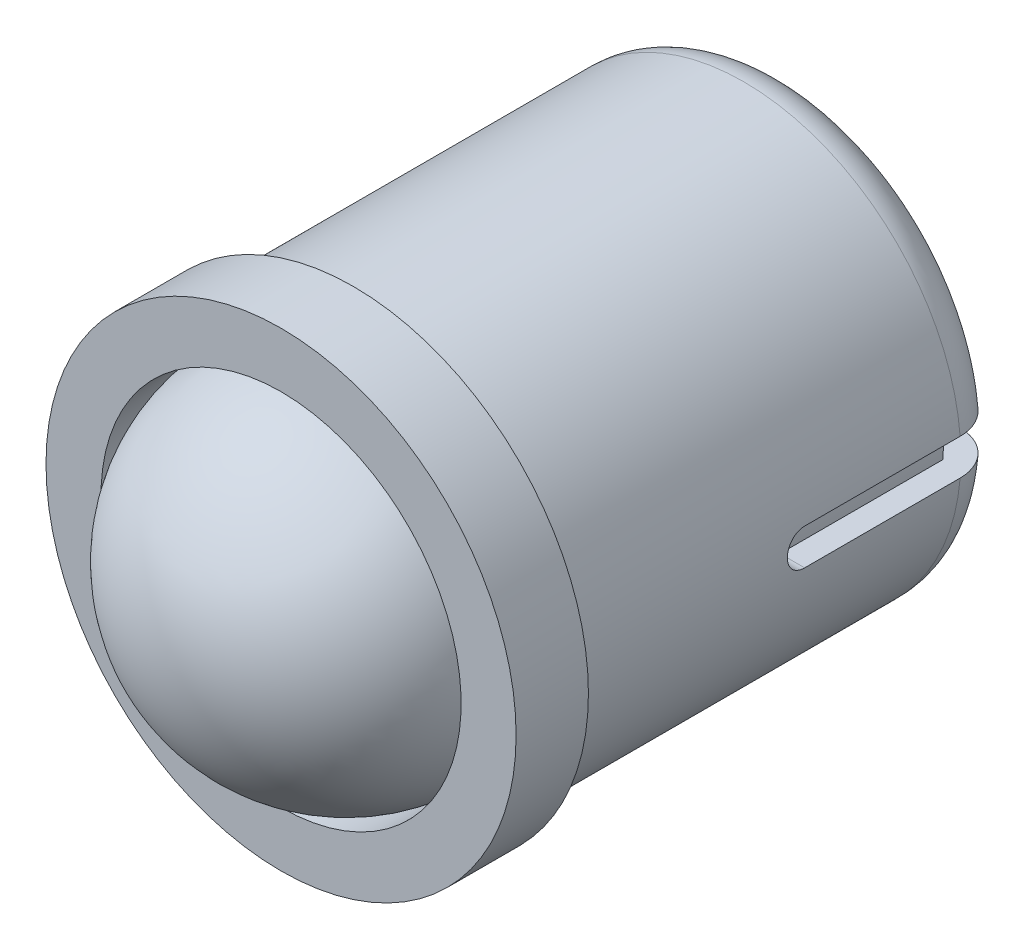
ISO-10303-21;
HEADER;
FILE_DESCRIPTION(('STEP AP214'),'2;1');
FILE_NAME('part.step','',(''),(''),'','','');
FILE_SCHEMA(('AUTOMOTIVE_DESIGN { 1 0 10303 214 1 1 1 1 }'));
ENDSEC;
DATA;
#1=APPLICATION_CONTEXT('core data for automotive mechanical design processes');
#2=APPLICATION_PROTOCOL_DEFINITION('international standard','automotive_design',2000,#1);
#3=PRODUCT_CONTEXT('',#1,'mechanical');
#4=PRODUCT('Part','Part','',(#3));
#5=PRODUCT_RELATED_PRODUCT_CATEGORY('part','',(#4));
#6=PRODUCT_DEFINITION_FORMATION('','',#4);
#7=PRODUCT_DEFINITION_CONTEXT('part definition',#1,'design');
#8=PRODUCT_DEFINITION('design','',#6,#7);
#9=PRODUCT_DEFINITION_SHAPE('','',#8);
#10=(LENGTH_UNIT() NAMED_UNIT(*) SI_UNIT(.MILLI.,.METRE.));
#11=(NAMED_UNIT(*) PLANE_ANGLE_UNIT() SI_UNIT($,.RADIAN.));
#12=(NAMED_UNIT(*) SI_UNIT($,.STERADIAN.) SOLID_ANGLE_UNIT());
#13=UNCERTAINTY_MEASURE_WITH_UNIT(LENGTH_MEASURE(1.E-05),#10,'distance_accuracy_value','');
#14=(GEOMETRIC_REPRESENTATION_CONTEXT(3) GLOBAL_UNCERTAINTY_ASSIGNED_CONTEXT((#13)) GLOBAL_UNIT_ASSIGNED_CONTEXT((#10,
#11,#12)) REPRESENTATION_CONTEXT('',''));
#15=CARTESIAN_POINT('',(0.,0.,0.));
#16=DIRECTION('',(0.,0.,1.));
#17=DIRECTION('',(1.,0.,0.));
#18=AXIS2_PLACEMENT_3D('',#15,#16,#17);
#19=CARTESIAN_POINT('',(3.25,0.,-3.25));
#20=DIRECTION('',(1.,0.,0.));
#21=DIRECTION('',(0.,1.,0.));
#22=AXIS2_PLACEMENT_3D('',#19,#20,#21);
#23=CYLINDRICAL_SURFACE('',#22,0.25);
#24=CARTESIAN_POINT('',(-2.6491943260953,0.25,-3.25));
#25=CARTESIAN_POINT('',(-2.64919448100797,0.249999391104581,-3.26400932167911));
#26=CARTESIAN_POINT('',(-2.64930664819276,0.24881846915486,-3.27802801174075));
#27=CARTESIAN_POINT('',(-2.64974315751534,0.244125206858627,-3.30567702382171));
#28=CARTESIAN_POINT('',(-2.65006773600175,0.240610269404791,-3.31930689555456));
#29=CARTESIAN_POINT('',(-2.65089198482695,0.231351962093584,-3.34577384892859));
#30=CARTESIAN_POINT('',(-2.65139155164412,0.225609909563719,-3.35861139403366));
#31=CARTESIAN_POINT('',(-2.65250936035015,0.212062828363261,-3.38313759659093));
#32=CARTESIAN_POINT('',(-2.65312757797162,0.204258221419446,-3.39482648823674));
#33=CARTESIAN_POINT('',(-2.65441526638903,0.186780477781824,-3.41676416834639));
#34=CARTESIAN_POINT('',(-2.65508487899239,0.177102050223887,-3.42700873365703));
#35=CARTESIAN_POINT('',(-2.65639861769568,0.156162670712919,-3.44573062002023));
#36=CARTESIAN_POINT('',(-2.65704274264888,0.14490164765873,-3.45420786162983));
#37=CARTESIAN_POINT('',(-2.65823431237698,0.121091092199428,-3.46916887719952));
#38=CARTESIAN_POINT('',(-2.65878157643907,0.108539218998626,-3.47564894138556));
#39=CARTESIAN_POINT('',(-2.65971622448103,0.0825195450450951,-3.4864079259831));
#40=CARTESIAN_POINT('',(-2.66010361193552,0.0690517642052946,-3.49068689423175));
#41=CARTESIAN_POINT('',(-2.66067386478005,0.041625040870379,-3.49690991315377));
#42=CARTESIAN_POINT('',(-2.6608573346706,0.0276676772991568,-3.49886086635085));
#43=CARTESIAN_POINT('',(-2.66100113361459,-0.000377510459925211,-3.50039382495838));
#44=CARTESIAN_POINT('',(-2.6609614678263,-0.0144653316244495,-3.49997588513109));
#45=CARTESIAN_POINT('',(-2.66066396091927,-0.0423246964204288,-3.49678854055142));
#46=CARTESIAN_POINT('',(-2.66040680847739,-0.0560970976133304,-3.49402655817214));
#47=CARTESIAN_POINT('',(-2.65970402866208,-0.0829819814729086,-3.48624108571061));
#48=CARTESIAN_POINT('',(-2.65925839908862,-0.0960944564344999,-3.48121756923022));
#49=CARTESIAN_POINT('',(-2.65822759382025,-0.121310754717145,-3.4690434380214));
#50=CARTESIAN_POINT('',(-2.65764220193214,-0.133412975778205,-3.46188952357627));
#51=CARTESIAN_POINT('',(-2.65639759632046,-0.1562477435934,-3.44566006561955));
#52=CARTESIAN_POINT('',(-2.65573838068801,-0.166980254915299,-3.43658447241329));
#53=CARTESIAN_POINT('',(-2.65441714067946,-0.186814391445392,-3.41672750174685));
#54=CARTESIAN_POINT('',(-2.65375511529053,-0.195909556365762,-3.40593967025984));
#55=CARTESIAN_POINT('',(-2.6525054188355,-0.212160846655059,-3.38298687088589));
#56=CARTESIAN_POINT('',(-2.65191774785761,-0.219316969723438,-3.37082190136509));
#57=CARTESIAN_POINT('',(-2.65088322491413,-0.231486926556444,-3.3454553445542));
#58=CARTESIAN_POINT('',(-2.650436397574,-0.236500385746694,-3.33225357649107));
#59=CARTESIAN_POINT('',(-2.64973465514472,-0.244237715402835,-3.30519051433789));
#60=CARTESIAN_POINT('',(-2.64947973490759,-0.246961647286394,-3.29132923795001));
#61=CARTESIAN_POINT('',(-2.64919154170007,-0.250034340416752,-3.26339727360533));
#62=CARTESIAN_POINT('',(-2.64915742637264,-0.250392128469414,-3.24932758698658));
#63=CARTESIAN_POINT('',(-2.64931248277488,-0.248746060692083,-3.22132845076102));
#64=CARTESIAN_POINT('',(-2.64950165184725,-0.246742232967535,-3.20739899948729));
#65=CARTESIAN_POINT('',(-2.65008119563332,-0.240437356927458,-3.18010189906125));
#66=CARTESIAN_POINT('',(-2.65047119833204,-0.236140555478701,-3.16673326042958));
#67=CARTESIAN_POINT('',(-2.65140816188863,-0.225376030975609,-3.14090655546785));
#68=CARTESIAN_POINT('',(-2.65195512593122,-0.218908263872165,-3.12844850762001));
#69=CARTESIAN_POINT('',(-2.65314642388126,-0.203962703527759,-3.10475541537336));
#70=CARTESIAN_POINT('',(-2.65379104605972,-0.19547891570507,-3.09352416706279));
#71=CARTESIAN_POINT('',(-2.65510407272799,-0.176750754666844,-3.07264193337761));
#72=CARTESIAN_POINT('',(-2.65577247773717,-0.166506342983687,-3.06299098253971));
#73=CARTESIAN_POINT('',(-2.65706028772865,-0.144508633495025,-3.04551229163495));
#74=CARTESIAN_POINT('',(-2.65767953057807,-0.13275065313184,-3.03769043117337));
#75=CARTESIAN_POINT('',(-2.65879689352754,-0.108082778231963,-3.02413236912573));
#76=CARTESIAN_POINT('',(-2.6592950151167,-0.0951728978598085,-3.01839614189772));
#77=CARTESIAN_POINT('',(-2.660113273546,-0.0685884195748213,-3.00918219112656));
#78=CARTESIAN_POINT('',(-2.66043369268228,-0.0549150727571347,-3.00570088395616));
#79=CARTESIAN_POINT('',(-2.66086159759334,-0.0271747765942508,-3.00108389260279));
#80=CARTESIAN_POINT('',(-2.66096908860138,-0.0131078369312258,-2.9999481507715));
#81=CARTESIAN_POINT('',(-2.66095902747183,0.0149625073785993,-3.0000552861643));
#82=CARTESIAN_POINT('',(-2.66084234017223,0.0289659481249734,-3.00128902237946));
#83=CARTESIAN_POINT('',(-2.66039874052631,0.0565657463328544,-3.00608096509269));
#84=CARTESIAN_POINT('',(-2.66007182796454,0.0701621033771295,-3.0096391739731));
#85=CARTESIAN_POINT('',(-2.65924442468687,0.0965619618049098,-3.0189766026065));
#86=CARTESIAN_POINT('',(-2.65874395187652,0.109365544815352,-3.02475559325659));
#87=CARTESIAN_POINT('',(-2.65762529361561,0.133822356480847,-3.0383695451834));
#88=CARTESIAN_POINT('',(-2.65700710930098,0.145475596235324,-3.04620448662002));
#89=CARTESIAN_POINT('',(-2.65571948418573,0.167347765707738,-3.06374225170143));
#90=CARTESIAN_POINT('',(-2.65504986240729,0.177561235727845,-3.07345187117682));
#91=CARTESIAN_POINT('',(-2.65373637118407,0.196218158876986,-3.09445030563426));
#92=CARTESIAN_POINT('',(-2.65309250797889,0.204661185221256,-3.10573950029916));
#93=CARTESIAN_POINT('',(-2.6519018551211,0.219552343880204,-3.12960433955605));
#94=CARTESIAN_POINT('',(-2.65135529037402,0.225995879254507,-3.14218286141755));
#95=CARTESIAN_POINT('',(-2.65042381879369,0.236670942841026,-3.1682402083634));
#96=CARTESIAN_POINT('',(-2.65003872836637,0.240904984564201,-3.18171799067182));
#97=CARTESIAN_POINT('',(-2.6495716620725,0.245976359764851,-3.20439444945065));
#98=CARTESIAN_POINT('',(-2.64943082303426,0.247483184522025,-3.21344780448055));
#99=CARTESIAN_POINT('',(-2.64924210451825,0.249495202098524,-3.23166610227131));
#100=CARTESIAN_POINT('',(-2.64919422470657,0.25000039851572,-3.24083104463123));
#101=CARTESIAN_POINT('',(-2.6491943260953,0.25,-3.25));
#102=B_SPLINE_CURVE_WITH_KNOTS('',3,(#24,#25,#26,#27,#28,#29,#30,#31,#32,#33,#34,#35,#36,#37,
#38,#39,#40,#41,#42,#43,#44,#45,#46,#47,#48,#49,#50,#51,#52,#53,#54,#55,#56,#57,#58,#59,#60,#61,
#62,#63,#64,#65,#66,#67,#68,#69,#70,#71,#72,#73,#74,#75,#76,#77,#78,#79,#80,#81,#82,#83,#84,#85,
#86,#87,#88,#89,#90,#91,#92,#93,#94,#95,#96,#97,#98,#99,#100,#101),.UNSPECIFIED.,.T.,.F.,(4,2,2,
2,2,2,2,2,2,2,2,2,2,2,2,2,2,2,2,2,2,2,2,2,2,2,2,2,2,2,2,2,2,2,2,2,2,2,4),(0.,0.0419944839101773,
0.084035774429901,0.126052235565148,0.168060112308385,0.210188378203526,0.252318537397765,
0.294526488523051,0.336733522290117,0.378815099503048,0.420895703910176,0.462843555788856,
0.504791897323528,0.546805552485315,0.588820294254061,0.630997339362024,0.673174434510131,
0.715358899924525,0.757542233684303,0.79956454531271,0.841586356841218,0.883530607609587,
0.925475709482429,0.967547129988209,1.00961946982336,1.05182524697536,1.09403050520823,
1.13616852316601,1.17830550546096,1.22028025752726,1.26225505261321,1.30422551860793,
1.34619557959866,1.38832074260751,1.43045604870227,1.47268752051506,1.51487084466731,
1.54235589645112,1.56984084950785),.UNSPECIFIED.);
#103=CARTESIAN_POINT('',(-2.64919432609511,-0.250000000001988,-3.25000000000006));
#104=VERTEX_POINT('',#103);
#105=CARTESIAN_POINT('',(-2.6491943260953,0.25,-3.25));
#106=VERTEX_POINT('',#105);
#107=EDGE_CURVE('E29',#104,#106,#102,.T.);
#108=ORIENTED_EDGE('',*,*,#107,.F.);
#109=DIRECTION('',(1.,0.,0.));
#110=VECTOR('',#109,1.);
#111=CARTESIAN_POINT('',(3.25,-0.25,-3.25));
#112=LINE('',#111,#110);
#113=CARTESIAN_POINT('',(-2.98956518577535,-0.25,-3.25));
#114=VERTEX_POINT('',#113);
#115=EDGE_CURVE('E79',#114,#104,#112,.T.);
#116=ORIENTED_EDGE('',*,*,#115,.F.);
#117=CARTESIAN_POINT('',(-2.98956518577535,0.25,-3.25));
#118=CARTESIAN_POINT('',(-2.98956136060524,0.250012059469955,-3.23596153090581));
#119=CARTESIAN_POINT('',(-2.98966396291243,0.248818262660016,-3.22192718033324));
#120=CARTESIAN_POINT('',(-2.9900536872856,0.244108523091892,-3.19426836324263));
#121=CARTESIAN_POINT('',(-2.99034064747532,0.240594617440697,-3.18064354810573));
#122=CARTESIAN_POINT('',(-2.99107099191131,0.231332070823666,-3.15417412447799));
#123=CARTESIAN_POINT('',(-2.99151443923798,0.225582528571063,-3.14132983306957));
#124=CARTESIAN_POINT('',(-2.99250644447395,0.212017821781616,-3.1167901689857));
#125=CARTESIAN_POINT('',(-2.99305498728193,0.204202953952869,-3.10509463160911));
#126=CARTESIAN_POINT('',(-2.99419721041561,0.186707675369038,-3.0831540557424));
#127=CARTESIAN_POINT('',(-2.99479098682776,0.177023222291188,-3.07291224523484));
#128=CARTESIAN_POINT('',(-2.99595588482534,0.156071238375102,-3.05419624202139));
#129=CARTESIAN_POINT('',(-2.99652700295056,0.144803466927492,-3.0457223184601));
#130=CARTESIAN_POINT('',(-2.99758311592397,0.120985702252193,-3.03077311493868));
#131=CARTESIAN_POINT('',(-2.9980679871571,0.108433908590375,-3.02430069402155));
#132=CARTESIAN_POINT('',(-2.99889588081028,0.0824177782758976,-3.01355686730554));
#133=CARTESIAN_POINT('',(-2.99923891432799,0.0689535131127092,-3.00928528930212));
#134=CARTESIAN_POINT('',(-2.9997438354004,0.0415271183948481,-3.00307341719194));
#135=CARTESIAN_POINT('',(-2.99990614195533,0.0275662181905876,-3.00112772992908));
#136=CARTESIAN_POINT('',(-3.00003274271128,-0.000485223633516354,-2.99960618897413));
#137=CARTESIAN_POINT('',(-2.99999703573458,-0.0145757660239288,-3.00003034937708));
#138=CARTESIAN_POINT('',(-2.99973197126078,-0.0424491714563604,-3.0032321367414));
#139=CARTESIAN_POINT('',(-2.99950309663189,-0.0562327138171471,-3.00600389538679));
#140=CARTESIAN_POINT('',(-2.99887799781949,-0.0831381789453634,-3.01381306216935));
#141=CARTESIAN_POINT('',(-2.99848177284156,-0.0962600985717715,-3.0188504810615));
#142=CARTESIAN_POINT('',(-2.99756570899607,-0.121488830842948,-3.03105463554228));
#143=CARTESIAN_POINT('',(-2.99704571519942,-0.13359434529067,-3.03822404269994));
#144=CARTESIAN_POINT('',(-2.99594058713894,-0.156431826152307,-3.05448635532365));
#145=CARTESIAN_POINT('',(-2.99535545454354,-0.167163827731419,-3.063579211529));
#146=CARTESIAN_POINT('',(-2.99418374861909,-0.186983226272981,-3.08346205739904));
#147=CARTESIAN_POINT('',(-2.99359717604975,-0.196065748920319,-3.0942569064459));
#148=CARTESIAN_POINT('',(-2.99249027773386,-0.212293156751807,-3.11722445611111));
#149=CARTESIAN_POINT('',(-2.99196997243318,-0.2194374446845,-3.12939757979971));
#150=CARTESIAN_POINT('',(-2.99105417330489,-0.23158591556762,-3.15478321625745));
#151=CARTESIAN_POINT('',(-2.99065876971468,-0.236588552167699,-3.16799647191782));
#152=CARTESIAN_POINT('',(-2.99003957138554,-0.244293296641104,-3.19506321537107));
#153=CARTESIAN_POINT('',(-2.98981551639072,-0.246998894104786,-3.20891569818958));
#154=CARTESIAN_POINT('',(-2.9896060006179,-0.249509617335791,-3.23189470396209));
#155=CARTESIAN_POINT('',(-2.98956402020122,-0.250004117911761,-3.24094962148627));
#156=CARTESIAN_POINT('',(-2.98956518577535,-0.25,-3.25));
#157=B_SPLINE_CURVE_WITH_KNOTS('',3,(#117,#118,#119,#120,#121,#122,#123,#124,#125,#126,#127,
#128,#129,#130,#131,#132,#133,#134,#135,#136,#137,#138,#139,#140,#141,#142,#143,#144,#145,#146,
#147,#148,#149,#150,#151,#152,#153,#154,#155,#156),.UNSPECIFIED.,.F.,.F.,(4,2,2,2,2,2,2,2,2,2,2,
2,2,2,2,2,2,2,2,4),(0.,0.042058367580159,0.0840798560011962,0.126118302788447,0.168150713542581,
0.210275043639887,0.252405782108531,0.294596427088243,0.336783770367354,0.378873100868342,
0.420962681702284,0.462947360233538,0.504932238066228,0.546969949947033,0.589006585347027,
0.63116548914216,0.673337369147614,0.715539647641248,0.757677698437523,0.784827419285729),.UNSPECIFIED.);
#158=CARTESIAN_POINT('',(-2.98956518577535,0.25,-3.25));
#159=VERTEX_POINT('',#158);
#160=EDGE_CURVE('E82',#159,#114,#157,.T.);
#161=ORIENTED_EDGE('',*,*,#160,.F.);
#162=DIRECTION('',(1.,0.,0.));
#163=VECTOR('',#162,1.);
#164=CARTESIAN_POINT('',(3.25,0.25,-3.25));
#165=LINE('',#164,#163);
#166=EDGE_CURVE('E74',#106,#159,#165,.F.);
#167=ORIENTED_EDGE('',*,*,#166,.F.);
#168=EDGE_LOOP('',(#108,#116,#161,#167));
#169=FACE_BOUND('',#168,.T.);
#170=ADVANCED_FACE('F14',(#169),#23,.F.);
#171=CARTESIAN_POINT('',(3.25,-0.25,-3.25));
#172=DIRECTION('',(0.,1.,0.));
#173=DIRECTION('',(0.,0.,1.));
#174=AXIS2_PLACEMENT_3D('',#171,#172,#173);
#175=PLANE('',#174);
#176=DIRECTION('',(0.,0.,1.));
#177=VECTOR('',#176,1.);
#178=CARTESIAN_POINT('',(-2.6491943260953,-0.25,4.29719094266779));
#179=LINE('',#178,#177);
#180=CARTESIAN_POINT('',(-2.6491943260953,-0.25,-5.5));
#181=VERTEX_POINT('',#180);
#182=EDGE_CURVE('E257',#104,#181,#179,.F.);
#183=ORIENTED_EDGE('',*,*,#182,.T.);
#184=DIRECTION('',(1.,0.,0.));
#185=VECTOR('',#184,1.);
#186=CARTESIAN_POINT('',(3.25,-0.25,-5.5));
#187=LINE('',#186,#185);
#188=CARTESIAN_POINT('',(2.6491943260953,-0.25,-5.5));
#189=VERTEX_POINT('',#188);
#190=EDGE_CURVE('E86',#181,#189,#187,.T.);
#191=ORIENTED_EDGE('',*,*,#190,.T.);
#192=DIRECTION('',(0.,0.,1.));
#193=VECTOR('',#192,1.);
#194=CARTESIAN_POINT('',(2.6491943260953,-0.25,4.29719094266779));
#195=LINE('',#194,#193);
#196=CARTESIAN_POINT('',(2.64919432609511,-0.250000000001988,-3.24999999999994));
#197=VERTEX_POINT('',#196);
#198=EDGE_CURVE('E256',#189,#197,#195,.T.);
#199=ORIENTED_EDGE('',*,*,#198,.T.);
#200=DIRECTION('',(1.,0.,0.));
#201=VECTOR('',#200,1.);
#202=CARTESIAN_POINT('',(3.25,-0.25,-3.25));
#203=LINE('',#202,#201);
#204=CARTESIAN_POINT('',(2.98956518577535,-0.25,-3.25));
#205=VERTEX_POINT('',#204);
#206=EDGE_CURVE('E67',#197,#205,#203,.T.);
#207=ORIENTED_EDGE('',*,*,#206,.T.);
#208=DIRECTION('',(0.,0.,-1.));
#209=VECTOR('',#208,1.);
#210=CARTESIAN_POINT('',(2.98956518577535,-0.25,1.));
#211=LINE('',#210,#209);
#212=CARTESIAN_POINT('',(2.98956518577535,-0.25,-5.4));
#213=VERTEX_POINT('',#212);
#214=EDGE_CURVE('E175',#213,#205,#211,.F.);
#215=ORIENTED_EDGE('',*,*,#214,.F.);
#216=CARTESIAN_POINT('',(2.98956518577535,-0.25,-5.4));
#217=CARTESIAN_POINT('',(2.98959425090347,-0.25,-5.43366459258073));
#218=CARTESIAN_POINT('',(2.9867237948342,-0.25,-5.46732005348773));
#219=CARTESIAN_POINT('',(2.97539897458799,-0.25,-5.53364919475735));
#220=CARTESIAN_POINT('',(2.966949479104,-0.25,-5.5663237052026));
#221=CARTESIAN_POINT('',(2.94467598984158,-0.25,-5.62980372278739));
#222=CARTESIAN_POINT('',(2.930849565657,-0.25,-5.66060837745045));
#223=CARTESIAN_POINT('',(2.89823201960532,-0.25,-5.71945898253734));
#224=CARTESIAN_POINT('',(2.87944165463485,-0.25,-5.74750535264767));
#225=CARTESIAN_POINT('',(2.83740161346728,-0.25,-5.80009386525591));
#226=CARTESIAN_POINT('',(2.81414566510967,-0.25,-5.82463099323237));
#227=CARTESIAN_POINT('',(2.76385593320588,-0.25,-5.86946850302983));
#228=CARTESIAN_POINT('',(2.73682208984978,-0.25,-5.88976881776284));
#229=CARTESIAN_POINT('',(2.6796443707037,-0.25,-5.92563543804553));
#230=CARTESIAN_POINT('',(2.64948958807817,-0.25,-5.94118433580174));
#231=CARTESIAN_POINT('',(2.5870102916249,-0.25,-5.9670162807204));
#232=CARTESIAN_POINT('',(2.55468688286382,-0.25,-5.97730198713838));
#233=CARTESIAN_POINT('',(2.49964171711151,-0.25,-5.98986571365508));
#234=CARTESIAN_POINT('',(2.4772548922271,-0.250000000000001,-5.99366441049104));
#235=CARTESIAN_POINT('',(2.43222950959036,-0.249999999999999,-5.99873127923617));
#236=CARTESIAN_POINT('',(2.40959136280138,-0.249999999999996,-6.00000310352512));
#237=CARTESIAN_POINT('',(2.38694365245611,-0.24999999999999,-6.));
#238=B_SPLINE_CURVE_WITH_KNOTS('',3,(#216,#217,#218,#219,#220,#221,#222,#223,#224,#225,#226,
#227,#228,#229,#230,#231,#232,#233,#234,#235,#236,#237),.UNSPECIFIED.,.F.,.F.,(4,2,2,2,2,2,2,2,
2,2,4),(0.,0.10085842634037,0.201628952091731,0.302445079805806,0.403245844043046,
0.504189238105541,0.60513423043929,0.706444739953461,0.807704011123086,0.875691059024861,
0.943579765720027),.UNSPECIFIED.);
#239=CARTESIAN_POINT('',(2.38694365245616,-0.250000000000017,-6.));
#240=VERTEX_POINT('',#239);
#241=EDGE_CURVE('E60',#213,#240,#238,.T.);
#242=ORIENTED_EDGE('',*,*,#241,.T.);
#243=DIRECTION('',(1.,0.,0.));
#244=VECTOR('',#243,1.);
#245=CARTESIAN_POINT('',(3.25,-0.25,-6.));
#246=LINE('',#245,#244);
#247=CARTESIAN_POINT('',(-2.3869436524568,-0.25,-6.));
#248=VERTEX_POINT('',#247);
#249=EDGE_CURVE('E166',#240,#248,#246,.F.);
#250=ORIENTED_EDGE('',*,*,#249,.T.);
#251=CARTESIAN_POINT('',(-2.3869436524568,-0.25,-6.));
#252=CARTESIAN_POINT('',(-2.42096660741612,-0.25,-6.0000285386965));
#253=CARTESIAN_POINT('',(-2.45498308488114,-0.25,-5.99713914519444));
#254=CARTESIAN_POINT('',(-2.52203674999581,-0.25,-5.98572468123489));
#255=CARTESIAN_POINT('',(-2.5550745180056,-0.25,-5.97720302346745));
#256=CARTESIAN_POINT('',(-2.61926643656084,-0.25,-5.95471728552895));
#257=CARTESIAN_POINT('',(-2.65041948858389,-0.25,-5.94075006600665));
#258=CARTESIAN_POINT('',(-2.70992158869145,-0.25,-5.90777241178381));
#259=CARTESIAN_POINT('',(-2.73827129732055,-0.25,-5.88876316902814));
#260=CARTESIAN_POINT('',(-2.79127590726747,-0.25,-5.84629567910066));
#261=CARTESIAN_POINT('',(-2.81594163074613,-0.25,-5.82285094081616));
#262=CARTESIAN_POINT('',(-2.86096609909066,-0.25,-5.7721378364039));
#263=CARTESIAN_POINT('',(-2.88132505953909,-0.25,-5.74486966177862));
#264=CARTESIAN_POINT('',(-2.91707626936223,-0.25,-5.68740014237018));
#265=CARTESIAN_POINT('',(-2.93248722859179,-0.25,-5.65721042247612));
#266=CARTESIAN_POINT('',(-2.95799606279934,-0.25,-5.59467339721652));
#267=CARTESIAN_POINT('',(-2.96809733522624,-0.25,-5.56232748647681));
#268=CARTESIAN_POINT('',(-2.98010771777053,-0.25,-5.50814258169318));
#269=CARTESIAN_POINT('',(-2.98365219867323,-0.250000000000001,-5.48665205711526));
#270=CARTESIAN_POINT('',(-2.98838052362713,-0.249999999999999,-5.44344410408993));
#271=CARTESIAN_POINT('',(-2.98956774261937,-0.249999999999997,-5.42172704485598));
#272=CARTESIAN_POINT('',(-2.98956518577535,-0.249999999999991,-5.4));
#273=B_SPLINE_CURVE_WITH_KNOTS('',3,(#251,#252,#253,#254,#255,#256,#257,#258,#259,#260,#261,
#262,#263,#264,#265,#266,#267,#268,#269,#270,#271,#272),.UNSPECIFIED.,.F.,.F.,(4,2,2,2,2,2,2,2,
2,2,4),(0.,0.101937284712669,0.203812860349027,0.305747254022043,0.407657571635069,
0.509262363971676,0.610862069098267,0.712072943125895,0.813218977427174,0.878441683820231,
0.943570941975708),.UNSPECIFIED.);
#274=CARTESIAN_POINT('',(-2.98956518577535,-0.25,-5.4));
#275=VERTEX_POINT('',#274);
#276=EDGE_CURVE('E94',#248,#275,#273,.T.);
#277=ORIENTED_EDGE('',*,*,#276,.T.);
#278=DIRECTION('',(0.,0.,-1.));
#279=VECTOR('',#278,1.);
#280=CARTESIAN_POINT('',(-2.98956518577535,-0.25,1.));
#281=LINE('',#280,#279);
#282=EDGE_CURVE('E90',#114,#275,#281,.T.);
#283=ORIENTED_EDGE('',*,*,#282,.F.);
#284=ORIENTED_EDGE('',*,*,#115,.T.);
#285=EDGE_LOOP('',(#183,#191,#199,#207,#215,#242,#250,#277,#283,#284));
#286=FACE_BOUND('',#285,.T.);
#287=ADVANCED_FACE('F91',(#286),#175,.T.);
#288=CARTESIAN_POINT('',(3.25,0.,-3.25));
#289=DIRECTION('',(1.,0.,0.));
#290=DIRECTION('',(0.,1.,0.));
#291=AXIS2_PLACEMENT_3D('',#288,#289,#290);
#292=CYLINDRICAL_SURFACE('',#291,0.25);
#293=CARTESIAN_POINT('',(2.6491943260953,0.25,-3.25));
#294=CARTESIAN_POINT('',(2.64919448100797,0.249999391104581,-3.23599067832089));
#295=CARTESIAN_POINT('',(2.64930664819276,0.24881846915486,-3.22197198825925));
#296=CARTESIAN_POINT('',(2.64974315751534,0.244125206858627,-3.19432297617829));
#297=CARTESIAN_POINT('',(2.65006773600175,0.240610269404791,-3.18069310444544));
#298=CARTESIAN_POINT('',(2.65089198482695,0.231351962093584,-3.15422615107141));
#299=CARTESIAN_POINT('',(2.65139155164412,0.225609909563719,-3.14138860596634));
#300=CARTESIAN_POINT('',(2.65250936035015,0.212062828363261,-3.11686240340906));
#301=CARTESIAN_POINT('',(2.65312757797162,0.204258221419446,-3.10517351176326));
#302=CARTESIAN_POINT('',(2.65441526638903,0.186780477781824,-3.08323583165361));
#303=CARTESIAN_POINT('',(2.65508487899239,0.177102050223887,-3.07299126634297));
#304=CARTESIAN_POINT('',(2.65639861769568,0.156162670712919,-3.05426937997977));
#305=CARTESIAN_POINT('',(2.65704274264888,0.14490164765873,-3.04579213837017));
#306=CARTESIAN_POINT('',(2.65823431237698,0.121091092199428,-3.03083112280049));
#307=CARTESIAN_POINT('',(2.65878157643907,0.108539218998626,-3.02435105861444));
#308=CARTESIAN_POINT('',(2.65971622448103,0.0825195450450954,-3.0135920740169));
#309=CARTESIAN_POINT('',(2.66010361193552,0.0690517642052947,-3.00931310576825));
#310=CARTESIAN_POINT('',(2.66067386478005,0.041625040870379,-3.00309008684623));
#311=CARTESIAN_POINT('',(2.6608573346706,0.0276676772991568,-3.00113913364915));
#312=CARTESIAN_POINT('',(2.66100113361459,-0.000377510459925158,-2.99960617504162));
#313=CARTESIAN_POINT('',(2.6609614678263,-0.0144653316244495,-3.00002411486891));
#314=CARTESIAN_POINT('',(2.66066396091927,-0.0423246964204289,-3.00321145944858));
#315=CARTESIAN_POINT('',(2.66040680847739,-0.0560970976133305,-3.00597344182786));
#316=CARTESIAN_POINT('',(2.65970402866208,-0.0829819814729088,-3.01375891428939));
#317=CARTESIAN_POINT('',(2.65925839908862,-0.0960944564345,-3.01878243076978));
#318=CARTESIAN_POINT('',(2.65822759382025,-0.121310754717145,-3.0309565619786));
#319=CARTESIAN_POINT('',(2.65764220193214,-0.133412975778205,-3.03811047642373));
#320=CARTESIAN_POINT('',(2.65639759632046,-0.1562477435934,-3.05433993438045));
#321=CARTESIAN_POINT('',(2.65573838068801,-0.166980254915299,-3.06341552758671));
#322=CARTESIAN_POINT('',(2.65441714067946,-0.186814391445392,-3.08327249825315));
#323=CARTESIAN_POINT('',(2.65375511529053,-0.195909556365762,-3.09406032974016));
#324=CARTESIAN_POINT('',(2.6525054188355,-0.21216084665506,-3.11701312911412));
#325=CARTESIAN_POINT('',(2.65191774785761,-0.219316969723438,-3.12917809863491));
#326=CARTESIAN_POINT('',(2.65088322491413,-0.231486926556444,-3.1545446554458));
#327=CARTESIAN_POINT('',(2.650436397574,-0.236500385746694,-3.16774642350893));
#328=CARTESIAN_POINT('',(2.64973465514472,-0.244237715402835,-3.19480948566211));
#329=CARTESIAN_POINT('',(2.64947973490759,-0.246961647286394,-3.20867076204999));
#330=CARTESIAN_POINT('',(2.64919154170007,-0.250034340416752,-3.23660272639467));
#331=CARTESIAN_POINT('',(2.64915742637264,-0.250392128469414,-3.25067241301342));
#332=CARTESIAN_POINT('',(2.64931248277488,-0.248746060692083,-3.27867154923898));
#333=CARTESIAN_POINT('',(2.64950165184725,-0.246742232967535,-3.29260100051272));
#334=CARTESIAN_POINT('',(2.65008119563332,-0.240437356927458,-3.31989810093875));
#335=CARTESIAN_POINT('',(2.65047119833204,-0.236140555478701,-3.33326673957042));
#336=CARTESIAN_POINT('',(2.65140816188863,-0.225376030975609,-3.35909344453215));
#337=CARTESIAN_POINT('',(2.65195512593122,-0.218908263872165,-3.37155149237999));
#338=CARTESIAN_POINT('',(2.65314642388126,-0.203962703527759,-3.39524458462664));
#339=CARTESIAN_POINT('',(2.65379104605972,-0.19547891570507,-3.40647583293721));
#340=CARTESIAN_POINT('',(2.65510407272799,-0.176750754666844,-3.42735806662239));
#341=CARTESIAN_POINT('',(2.65577247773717,-0.166506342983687,-3.43700901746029));
#342=CARTESIAN_POINT('',(2.65706028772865,-0.144508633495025,-3.45448770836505));
#343=CARTESIAN_POINT('',(2.65767953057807,-0.13275065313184,-3.46230956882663));
#344=CARTESIAN_POINT('',(2.65879689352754,-0.108082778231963,-3.47586763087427));
#345=CARTESIAN_POINT('',(2.6592950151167,-0.0951728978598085,-3.48160385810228));
#346=CARTESIAN_POINT('',(2.660113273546,-0.0685884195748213,-3.49081780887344));
#347=CARTESIAN_POINT('',(2.66043369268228,-0.0549150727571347,-3.49429911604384));
#348=CARTESIAN_POINT('',(2.66086159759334,-0.0271747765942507,-3.49891610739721));
#349=CARTESIAN_POINT('',(2.66096908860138,-0.0131078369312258,-3.5000518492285));
#350=CARTESIAN_POINT('',(2.66095902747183,0.0149625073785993,-3.4999447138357));
#351=CARTESIAN_POINT('',(2.66084234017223,0.0289659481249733,-3.49871097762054));
#352=CARTESIAN_POINT('',(2.66039874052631,0.0565657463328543,-3.49391903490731));
#353=CARTESIAN_POINT('',(2.66007182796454,0.0701621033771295,-3.4903608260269));
#354=CARTESIAN_POINT('',(2.65924442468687,0.0965619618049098,-3.4810233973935));
#355=CARTESIAN_POINT('',(2.65874395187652,0.109365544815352,-3.47524440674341));
#356=CARTESIAN_POINT('',(2.65762529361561,0.133822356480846,-3.4616304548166));
#357=CARTESIAN_POINT('',(2.65700710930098,0.145475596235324,-3.45379551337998));
#358=CARTESIAN_POINT('',(2.65571948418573,0.167347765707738,-3.43625774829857));
#359=CARTESIAN_POINT('',(2.65504986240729,0.177561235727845,-3.42654812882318));
#360=CARTESIAN_POINT('',(2.65373637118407,0.196218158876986,-3.40554969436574));
#361=CARTESIAN_POINT('',(2.65309250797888,0.204661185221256,-3.39426049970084));
#362=CARTESIAN_POINT('',(2.6519018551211,0.219552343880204,-3.37039566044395));
#363=CARTESIAN_POINT('',(2.65135529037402,0.225995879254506,-3.35781713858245));
#364=CARTESIAN_POINT('',(2.65042381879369,0.236670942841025,-3.3317597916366));
#365=CARTESIAN_POINT('',(2.65003872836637,0.240904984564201,-3.31828200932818));
#366=CARTESIAN_POINT('',(2.6495716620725,0.245976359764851,-3.29560555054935));
#367=CARTESIAN_POINT('',(2.64943082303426,0.247483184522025,-3.28655219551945));
#368=CARTESIAN_POINT('',(2.64924210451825,0.249495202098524,-3.26833389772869));
#369=CARTESIAN_POINT('',(2.64919422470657,0.25000039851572,-3.25916895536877));
#370=CARTESIAN_POINT('',(2.6491943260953,0.25,-3.25));
#371=B_SPLINE_CURVE_WITH_KNOTS('',3,(#293,#294,#295,#296,#297,#298,#299,#300,#301,#302,#303,
#304,#305,#306,#307,#308,#309,#310,#311,#312,#313,#314,#315,#316,#317,#318,#319,#320,#321,#322,
#323,#324,#325,#326,#327,#328,#329,#330,#331,#332,#333,#334,#335,#336,#337,#338,#339,#340,#341,
#342,#343,#344,#345,#346,#347,#348,#349,#350,#351,#352,#353,#354,#355,#356,#357,#358,#359,#360,
#361,#362,#363,#364,#365,#366,#367,#368,#369,#370),.UNSPECIFIED.,.T.,.F.,(4,2,2,2,2,2,2,2,2,2,2,
2,2,2,2,2,2,2,2,2,2,2,2,2,2,2,2,2,2,2,2,2,2,2,2,2,2,2,4),(0.,0.0419944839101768,
0.0840357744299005,0.126052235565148,0.168060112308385,0.210188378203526,0.252318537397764,
0.294526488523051,0.336733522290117,0.378815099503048,0.420895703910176,0.462843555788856,
0.504791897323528,0.546805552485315,0.58882029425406,0.630997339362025,0.673174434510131,
0.715358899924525,0.757542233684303,0.79956454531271,0.841586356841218,0.883530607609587,
0.925475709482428,0.967547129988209,1.00961946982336,1.05182524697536,1.09403050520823,
1.13616852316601,1.17830550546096,1.22028025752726,1.26225505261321,1.30422551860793,
1.34619557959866,1.38832074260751,1.43045604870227,1.47268752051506,1.51487084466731,
1.54235589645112,1.56984084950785),.UNSPECIFIED.);
#372=CARTESIAN_POINT('',(2.6491943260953,0.25,-3.25));
#373=VERTEX_POINT('',#372);
#374=EDGE_CURVE('E248',#373,#197,#371,.T.);
#375=ORIENTED_EDGE('',*,*,#374,.F.);
#376=DIRECTION('',(1.,0.,0.));
#377=VECTOR('',#376,1.);
#378=CARTESIAN_POINT('',(3.25,0.25,-3.25));
#379=LINE('',#378,#377);
#380=CARTESIAN_POINT('',(2.98956518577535,0.25,-3.25));
#381=VERTEX_POINT('',#380);
#382=EDGE_CURVE('E160',#381,#373,#379,.F.);
#383=ORIENTED_EDGE('',*,*,#382,.F.);
#384=CARTESIAN_POINT('',(2.98956518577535,-0.25,-3.25));
#385=CARTESIAN_POINT('',(2.98956136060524,-0.250012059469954,-3.23596153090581));
#386=CARTESIAN_POINT('',(2.98966396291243,-0.248818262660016,-3.22192718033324));
#387=CARTESIAN_POINT('',(2.9900536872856,-0.244108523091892,-3.19426836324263));
#388=CARTESIAN_POINT('',(2.99034064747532,-0.240594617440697,-3.18064354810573));
#389=CARTESIAN_POINT('',(2.99107099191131,-0.231332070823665,-3.15417412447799));
#390=CARTESIAN_POINT('',(2.99151443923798,-0.225582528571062,-3.14132983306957));
#391=CARTESIAN_POINT('',(2.99250644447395,-0.212017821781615,-3.1167901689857));
#392=CARTESIAN_POINT('',(2.99305498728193,-0.204202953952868,-3.10509463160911));
#393=CARTESIAN_POINT('',(2.99419721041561,-0.186707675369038,-3.0831540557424));
#394=CARTESIAN_POINT('',(2.99479098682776,-0.177023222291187,-3.07291224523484));
#395=CARTESIAN_POINT('',(2.99595588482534,-0.156071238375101,-3.05419624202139));
#396=CARTESIAN_POINT('',(2.99652700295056,-0.144803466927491,-3.0457223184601));
#397=CARTESIAN_POINT('',(2.99758311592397,-0.120985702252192,-3.03077311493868));
#398=CARTESIAN_POINT('',(2.9980679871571,-0.108433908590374,-3.02430069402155));
#399=CARTESIAN_POINT('',(2.99889588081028,-0.0824177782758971,-3.01355686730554));
#400=CARTESIAN_POINT('',(2.99923891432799,-0.0689535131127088,-3.00928528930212));
#401=CARTESIAN_POINT('',(2.9997438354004,-0.0415271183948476,-3.00307341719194));
#402=CARTESIAN_POINT('',(2.99990614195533,-0.0275662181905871,-3.00112772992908));
#403=CARTESIAN_POINT('',(3.00003274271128,0.000485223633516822,-2.99960618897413));
#404=CARTESIAN_POINT('',(2.99999703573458,0.0145757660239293,-3.00003034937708));
#405=CARTESIAN_POINT('',(2.99973197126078,0.0424491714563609,-3.0032321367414));
#406=CARTESIAN_POINT('',(2.99950309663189,0.0562327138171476,-3.00600389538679));
#407=CARTESIAN_POINT('',(2.99887799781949,0.083138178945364,-3.01381306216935));
#408=CARTESIAN_POINT('',(2.99848177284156,0.0962600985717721,-3.0188504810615));
#409=CARTESIAN_POINT('',(2.99756570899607,0.121488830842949,-3.03105463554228));
#410=CARTESIAN_POINT('',(2.99704571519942,0.13359434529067,-3.03822404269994));
#411=CARTESIAN_POINT('',(2.99594058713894,0.156431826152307,-3.05448635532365));
#412=CARTESIAN_POINT('',(2.99535545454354,0.16716382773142,-3.063579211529));
#413=CARTESIAN_POINT('',(2.99418374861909,0.186983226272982,-3.08346205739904));
#414=CARTESIAN_POINT('',(2.99359717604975,0.19606574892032,-3.0942569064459));
#415=CARTESIAN_POINT('',(2.99249027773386,0.212293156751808,-3.11722445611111));
#416=CARTESIAN_POINT('',(2.99196997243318,0.219437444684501,-3.12939757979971));
#417=CARTESIAN_POINT('',(2.99105417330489,0.23158591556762,-3.15478321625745));
#418=CARTESIAN_POINT('',(2.99065876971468,0.2365885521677,-3.16799647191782));
#419=CARTESIAN_POINT('',(2.99003957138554,0.244293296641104,-3.19506321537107));
#420=CARTESIAN_POINT('',(2.98981551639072,0.246998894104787,-3.20891569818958));
#421=CARTESIAN_POINT('',(2.9896060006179,0.249509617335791,-3.23189470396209));
#422=CARTESIAN_POINT('',(2.98956402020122,0.250004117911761,-3.24094962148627));
#423=CARTESIAN_POINT('',(2.98956518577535,0.25,-3.25));
#424=B_SPLINE_CURVE_WITH_KNOTS('',3,(#384,#385,#386,#387,#388,#389,#390,#391,#392,#393,#394,
#395,#396,#397,#398,#399,#400,#401,#402,#403,#404,#405,#406,#407,#408,#409,#410,#411,#412,#413,
#414,#415,#416,#417,#418,#419,#420,#421,#422,#423),.UNSPECIFIED.,.F.,.F.,(4,2,2,2,2,2,2,2,2,2,2,
2,2,2,2,2,2,2,2,4),(0.,0.0420583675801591,0.0840798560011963,0.126118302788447,
0.168150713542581,0.210275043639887,0.252405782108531,0.294596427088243,0.336783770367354,
0.378873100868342,0.420962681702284,0.462947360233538,0.504932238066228,0.546969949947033,
0.589006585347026,0.63116548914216,0.673337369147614,0.715539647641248,0.757677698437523,
0.784827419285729),.UNSPECIFIED.);
#425=EDGE_CURVE('E115',#205,#381,#424,.T.);
#426=ORIENTED_EDGE('',*,*,#425,.F.);
#427=ORIENTED_EDGE('',*,*,#206,.F.);
#428=EDGE_LOOP('',(#375,#383,#426,#427));
#429=FACE_BOUND('',#428,.T.);
#430=ADVANCED_FACE('F236',(#429),#292,.F.);
#431=CARTESIAN_POINT('',(3.25,0.25,-6.));
#432=DIRECTION('',(0.,-1.,0.));
#433=DIRECTION('',(0.,0.,-1.));
#434=AXIS2_PLACEMENT_3D('',#431,#432,#433);
#435=PLANE('',#434);
#436=DIRECTION('',(0.,0.,1.));
#437=VECTOR('',#436,1.);
#438=CARTESIAN_POINT('',(2.6491943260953,0.25,4.29719094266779));
#439=LINE('',#438,#437);
#440=CARTESIAN_POINT('',(2.6491943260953,0.25,-5.5));
#441=VERTEX_POINT('',#440);
#442=EDGE_CURVE('E9',#373,#441,#439,.F.);
#443=ORIENTED_EDGE('',*,*,#442,.T.);
#444=DIRECTION('',(1.,0.,0.));
#445=VECTOR('',#444,1.);
#446=CARTESIAN_POINT('',(3.25,0.25,-5.5));
#447=LINE('',#446,#445);
#448=CARTESIAN_POINT('',(-2.6491943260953,0.25,-5.5));
#449=VERTEX_POINT('',#448);
#450=EDGE_CURVE('E157',#441,#449,#447,.F.);
#451=ORIENTED_EDGE('',*,*,#450,.T.);
#452=DIRECTION('',(0.,0.,1.));
#453=VECTOR('',#452,1.);
#454=CARTESIAN_POINT('',(-2.6491943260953,0.25,4.29719094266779));
#455=LINE('',#454,#453);
#456=EDGE_CURVE('E22',#449,#106,#455,.T.);
#457=ORIENTED_EDGE('',*,*,#456,.T.);
#458=ORIENTED_EDGE('',*,*,#166,.T.);
#459=DIRECTION('',(0.,0.,-1.));
#460=VECTOR('',#459,1.);
#461=CARTESIAN_POINT('',(-2.98956518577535,0.25,1.));
#462=LINE('',#461,#460);
#463=CARTESIAN_POINT('',(-2.98956518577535,0.25,-5.4));
#464=VERTEX_POINT('',#463);
#465=EDGE_CURVE('E103',#464,#159,#462,.F.);
#466=ORIENTED_EDGE('',*,*,#465,.F.);
#467=CARTESIAN_POINT('',(-2.38694365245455,0.25,-6.));
#468=CARTESIAN_POINT('',(-2.42096660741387,0.25,-6.00002853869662));
#469=CARTESIAN_POINT('',(-2.4549830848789,0.25,-5.99713914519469));
#470=CARTESIAN_POINT('',(-2.52203674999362,0.25,-5.98572468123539));
#471=CARTESIAN_POINT('',(-2.55507451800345,0.25,-5.97720302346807));
#472=CARTESIAN_POINT('',(-2.61926643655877,0.25,-5.95471728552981));
#473=CARTESIAN_POINT('',(-2.65041948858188,0.25,-5.94075006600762));
#474=CARTESIAN_POINT('',(-2.70992158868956,0.25,-5.907772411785));
#475=CARTESIAN_POINT('',(-2.73827129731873,0.25,-5.88876316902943));
#476=CARTESIAN_POINT('',(-2.79127590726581,0.25,-5.84629567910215));
#477=CARTESIAN_POINT('',(-2.81594163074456,0.25,-5.82285094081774));
#478=CARTESIAN_POINT('',(-2.86096609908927,0.25,-5.77213783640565));
#479=CARTESIAN_POINT('',(-2.88132505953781,0.25,-5.74486966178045));
#480=CARTESIAN_POINT('',(-2.91707626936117,0.25,-5.68740014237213));
#481=CARTESIAN_POINT('',(-2.93248722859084,0.25,-5.65721042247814));
#482=CARTESIAN_POINT('',(-2.95799606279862,0.25,-5.59467339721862));
#483=CARTESIAN_POINT('',(-2.96809733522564,0.25,-5.56232748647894));
#484=CARTESIAN_POINT('',(-2.98010771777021,0.25,-5.508142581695));
#485=CARTESIAN_POINT('',(-2.98365219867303,0.25,-5.48665205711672));
#486=CARTESIAN_POINT('',(-2.98838052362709,0.25,-5.44344410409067));
#487=CARTESIAN_POINT('',(-2.98956774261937,0.249999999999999,-5.42172704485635));
#488=CARTESIAN_POINT('',(-2.98956518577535,0.249999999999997,-5.4));
#489=B_SPLINE_CURVE_WITH_KNOTS('',3,(#467,#468,#469,#470,#471,#472,#473,#474,#475,#476,#477,
#478,#479,#480,#481,#482,#483,#484,#485,#486,#487,#488),.UNSPECIFIED.,.F.,.F.,(4,2,2,2,2,2,2,2,
2,2,4),(0.,0.101937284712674,0.203812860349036,0.305747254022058,0.407657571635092,
0.509262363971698,0.61086206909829,0.712072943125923,0.81321897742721,0.878441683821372,
0.943570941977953),.UNSPECIFIED.);
#490=CARTESIAN_POINT('',(-2.38694365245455,0.250000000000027,-6.));
#491=VERTEX_POINT('',#490);
#492=EDGE_CURVE('E454',#491,#464,#489,.T.);
#493=ORIENTED_EDGE('',*,*,#492,.F.);
#494=DIRECTION('',(1.,0.,0.));
#495=VECTOR('',#494,1.);
#496=CARTESIAN_POINT('',(3.25,0.25,-6.));
#497=LINE('',#496,#495);
#498=CARTESIAN_POINT('',(2.38694365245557,0.25,-6.));
#499=VERTEX_POINT('',#498);
#500=EDGE_CURVE('E152',#491,#499,#497,.T.);
#501=ORIENTED_EDGE('',*,*,#500,.T.);
#502=CARTESIAN_POINT('',(2.98956518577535,0.25,-5.4));
#503=CARTESIAN_POINT('',(2.98959425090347,0.25,-5.43366459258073));
#504=CARTESIAN_POINT('',(2.9867237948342,0.25,-5.46732005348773));
#505=CARTESIAN_POINT('',(2.97539897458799,0.25,-5.53364919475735));
#506=CARTESIAN_POINT('',(2.966949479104,0.25,-5.5663237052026));
#507=CARTESIAN_POINT('',(2.94467598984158,0.25,-5.62980372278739));
#508=CARTESIAN_POINT('',(2.930849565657,0.25,-5.66060837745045));
#509=CARTESIAN_POINT('',(2.89823201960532,0.25,-5.71945898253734));
#510=CARTESIAN_POINT('',(2.87944165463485,0.25,-5.74750535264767));
#511=CARTESIAN_POINT('',(2.83740161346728,0.25,-5.80009386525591));
#512=CARTESIAN_POINT('',(2.81414566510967,0.25,-5.82463099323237));
#513=CARTESIAN_POINT('',(2.76385593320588,0.25,-5.86946850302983));
#514=CARTESIAN_POINT('',(2.73682208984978,0.25,-5.88976881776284));
#515=CARTESIAN_POINT('',(2.6796443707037,0.25,-5.92563543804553));
#516=CARTESIAN_POINT('',(2.64948958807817,0.25,-5.94118433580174));
#517=CARTESIAN_POINT('',(2.5870102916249,0.25,-5.9670162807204));
#518=CARTESIAN_POINT('',(2.55468688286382,0.25,-5.97730198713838));
#519=CARTESIAN_POINT('',(2.49964171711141,0.25,-5.9898657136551));
#520=CARTESIAN_POINT('',(2.4772548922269,0.250000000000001,-5.99366441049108));
#521=CARTESIAN_POINT('',(2.43222950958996,0.249999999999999,-5.99873127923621));
#522=CARTESIAN_POINT('',(2.40959136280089,0.249999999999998,-6.00000310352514));
#523=CARTESIAN_POINT('',(2.38694365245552,0.249999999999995,-6.));
#524=B_SPLINE_CURVE_WITH_KNOTS('',3,(#502,#503,#504,#505,#506,#507,#508,#509,#510,#511,#512,
#513,#514,#515,#516,#517,#518,#519,#520,#521,#522,#523),.UNSPECIFIED.,.F.,.F.,(4,2,2,2,2,2,2,2,
2,2,4),(0.,0.10085842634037,0.201628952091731,0.302445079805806,0.403245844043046,
0.504189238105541,0.60513423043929,0.706444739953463,0.807704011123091,0.875691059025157,
0.943579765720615),.UNSPECIFIED.);
#525=CARTESIAN_POINT('',(2.98956518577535,0.25,-5.4));
#526=VERTEX_POINT('',#525);
#527=EDGE_CURVE('E38',#526,#499,#524,.T.);
#528=ORIENTED_EDGE('',*,*,#527,.F.);
#529=DIRECTION('',(0.,0.,-1.));
#530=VECTOR('',#529,1.);
#531=CARTESIAN_POINT('',(2.98956518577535,0.25,1.));
#532=LINE('',#531,#530);
#533=EDGE_CURVE('E151',#381,#526,#532,.T.);
#534=ORIENTED_EDGE('',*,*,#533,.F.);
#535=ORIENTED_EDGE('',*,*,#382,.T.);
#536=EDGE_LOOP('',(#443,#451,#457,#458,#466,#493,#501,#528,#534,#535));
#537=FACE_BOUND('',#536,.T.);
#538=ADVANCED_FACE('F141',(#537),#435,.T.);
#539=CARTESIAN_POINT('',(0.,0.,1.));
#540=DIRECTION('',(0.,0.,-1.));
#541=DIRECTION('',(0.,1.,0.));
#542=AXIS2_PLACEMENT_3D('',#539,#540,#541);
#543=CYLINDRICAL_SURFACE('',#542,2.49);
#544=CARTESIAN_POINT('',(0.,0.,1.));
#545=DIRECTION('',(0.,0.,-1.));
#546=DIRECTION('',(0.,1.,0.));
#547=AXIS2_PLACEMENT_3D('',#544,#545,#546);
#548=CIRCLE('',#547,2.49);
#549=CARTESIAN_POINT('',(0.,2.49,1.));
#550=VERTEX_POINT('',#549);
#551=EDGE_CURVE('E289',#550,#550,#548,.F.);
#552=ORIENTED_EDGE('',*,*,#551,.T.);
#553=EDGE_LOOP('',(#552));
#554=FACE_BOUND('',#553,.T.);
#555=CARTESIAN_POINT('',(0.,0.,0.323383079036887));
#556=DIRECTION('',(0.,0.,-1.));
#557=DIRECTION('',(0.,1.,0.));
#558=AXIS2_PLACEMENT_3D('',#555,#556,#557);
#559=CIRCLE('',#558,2.49);
#560=CARTESIAN_POINT('',(0.,2.49,0.323383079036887));
#561=VERTEX_POINT('',#560);
#562=EDGE_CURVE('E150',#561,#561,#559,.F.);
#563=ORIENTED_EDGE('',*,*,#562,.F.);
#564=EDGE_LOOP('',(#563));
#565=FACE_BOUND('',#564,.T.);
#566=ADVANCED_FACE('F132',(#554,#565),#543,.F.);
#567=CARTESIAN_POINT('',(3.25,0.,1.));
#568=DIRECTION('',(0.,0.,-1.));
#569=DIRECTION('',(0.,1.,0.));
#570=AXIS2_PLACEMENT_3D('',#567,#568,#569);
#571=PLANE('',#570);
#572=CARTESIAN_POINT('',(0.,0.,1.));
#573=DIRECTION('',(0.,0.,-1.));
#574=DIRECTION('',(0.,1.,0.));
#575=AXIS2_PLACEMENT_3D('',#572,#573,#574);
#576=CIRCLE('',#575,3.25);
#577=CARTESIAN_POINT('',(0.,3.25,1.));
#578=VERTEX_POINT('',#577);
#579=EDGE_CURVE('E310',#578,#578,#576,.T.);
#580=ORIENTED_EDGE('',*,*,#579,.F.);
#581=EDGE_LOOP('',(#580));
#582=FACE_BOUND('',#581,.T.);
#583=ORIENTED_EDGE('',*,*,#551,.F.);
#584=EDGE_LOOP('',(#583));
#585=FACE_BOUND('',#584,.T.);
#586=ADVANCED_FACE('F16',(#582,#585),#571,.F.);
#587=CARTESIAN_POINT('',(0.,0.,1.));
#588=DIRECTION('',(0.,0.,-1.));
#589=DIRECTION('',(0.,1.,0.));
#590=AXIS2_PLACEMENT_3D('',#587,#588,#589);
#591=CYLINDRICAL_SURFACE('',#590,3.25);
#592=CARTESIAN_POINT('',(0.,0.,0.));
#593=DIRECTION('',(0.,0.,-1.));
#594=DIRECTION('',(0.,1.,0.));
#595=AXIS2_PLACEMENT_3D('',#592,#593,#594);
#596=CIRCLE('',#595,3.25);
#597=CARTESIAN_POINT('',(0.,3.25,0.));
#598=VERTEX_POINT('',#597);
#599=EDGE_CURVE('E301',#598,#598,#596,.F.);
#600=ORIENTED_EDGE('',*,*,#599,.T.);
#601=EDGE_LOOP('',(#600));
#602=FACE_BOUND('',#601,.T.);
#603=ORIENTED_EDGE('',*,*,#579,.T.);
#604=EDGE_LOOP('',(#603));
#605=FACE_BOUND('',#604,.T.);
#606=ADVANCED_FACE('F220',(#602,#605),#591,.T.);
#607=CARTESIAN_POINT('',(0.,0.,-6.));
#608=DIRECTION('',(0.,0.,1.));
#609=DIRECTION('',(0.,-1.,0.));
#610=AXIS2_PLACEMENT_3D('',#607,#608,#609);
#611=PLANE('',#610);
#612=CARTESIAN_POINT('',(0.,0.,-6.));
#613=DIRECTION('',(0.,0.,1.));
#614=DIRECTION('',(-0.994559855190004,-0.104166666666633,0.));
#615=AXIS2_PLACEMENT_3D('',#612,#613,#614);
#616=CIRCLE('',#615,2.40000000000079);
#617=EDGE_CURVE('E87',#248,#240,#616,.T.);
#618=ORIENTED_EDGE('',*,*,#617,.F.);
#619=ORIENTED_EDGE('',*,*,#249,.F.);
#620=EDGE_LOOP('',(#618,#619));
#621=FACE_BOUND('',#620,.T.);
#622=ADVANCED_FACE('F210',(#621),#611,.F.);
#623=CARTESIAN_POINT('',(0.,0.,-6.));
#624=DIRECTION('',(0.,0.,1.));
#625=DIRECTION('',(0.,-1.,0.));
#626=AXIS2_PLACEMENT_3D('',#623,#624,#625);
#627=PLANE('',#626);
#628=CARTESIAN_POINT('',(0.,0.,-6.));
#629=DIRECTION('',(0.,0.,1.));
#630=DIRECTION('',(0.994559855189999,0.104166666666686,0.));
#631=AXIS2_PLACEMENT_3D('',#628,#629,#630);
#632=CIRCLE('',#631,2.39999999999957);
#633=EDGE_CURVE('E154',#499,#491,#632,.T.);
#634=ORIENTED_EDGE('',*,*,#633,.F.);
#635=ORIENTED_EDGE('',*,*,#500,.F.);
#636=EDGE_LOOP('',(#634,#635));
#637=FACE_BOUND('',#636,.T.);
#638=ADVANCED_FACE('F219',(#637),#627,.F.);
#639=CARTESIAN_POINT('',(3.,0.,0.));
#640=DIRECTION('',(0.,0.,1.));
#641=DIRECTION('',(0.,-1.,0.));
#642=AXIS2_PLACEMENT_3D('',#639,#640,#641);
#643=PLANE('',#642);
#644=CARTESIAN_POINT('',(0.,0.,0.));
#645=DIRECTION('',(0.,0.,-1.));
#646=DIRECTION('',(0.,1.,0.));
#647=AXIS2_PLACEMENT_3D('',#644,#645,#646);
#648=CIRCLE('',#647,3.);
#649=CARTESIAN_POINT('',(0.,3.,0.));
#650=VERTEX_POINT('',#649);
#651=EDGE_CURVE('E105',#650,#650,#648,.T.);
#652=ORIENTED_EDGE('',*,*,#651,.F.);
#653=EDGE_LOOP('',(#652));
#654=FACE_BOUND('',#653,.T.);
#655=ORIENTED_EDGE('',*,*,#599,.F.);
#656=EDGE_LOOP('',(#655));
#657=FACE_BOUND('',#656,.T.);
#658=ADVANCED_FACE('F181',(#654,#657),#643,.F.);
#659=CARTESIAN_POINT('',(0.,0.,-5.4));
#660=DIRECTION('',(0.,0.,1.));
#661=DIRECTION('',(0.,-1.,0.));
#662=AXIS2_PLACEMENT_3D('',#659,#660,#661);
#663=TOROIDAL_SURFACE('',#662,2.4,0.6);
#664=ORIENTED_EDGE('',*,*,#617,.T.);
#665=ORIENTED_EDGE('',*,*,#241,.F.);
#666=CARTESIAN_POINT('',(0.,0.,-5.4));
#667=DIRECTION('',(0.,0.,-1.));
#668=DIRECTION('',(0.,1.,0.));
#669=AXIS2_PLACEMENT_3D('',#666,#667,#668);
#670=CIRCLE('',#669,3.);
#671=EDGE_CURVE('E97',#275,#213,#670,.F.);
#672=ORIENTED_EDGE('',*,*,#671,.F.);
#673=ORIENTED_EDGE('',*,*,#276,.F.);
#674=EDGE_LOOP('',(#664,#665,#672,#673));
#675=FACE_BOUND('',#674,.T.);
#676=ADVANCED_FACE('F139',(#675),#663,.T.);
#677=CARTESIAN_POINT('',(0.,0.,-5.4));
#678=DIRECTION('',(0.,0.,1.));
#679=DIRECTION('',(0.,-1.,0.));
#680=AXIS2_PLACEMENT_3D('',#677,#678,#679);
#681=TOROIDAL_SURFACE('',#680,2.4,0.6);
#682=CARTESIAN_POINT('',(0.,0.,-5.4));
#683=DIRECTION('',(0.,0.,-1.));
#684=DIRECTION('',(0.,1.,0.));
#685=AXIS2_PLACEMENT_3D('',#682,#683,#684);
#686=CIRCLE('',#685,3.);
#687=EDGE_CURVE('E148',#526,#464,#686,.F.);
#688=ORIENTED_EDGE('',*,*,#687,.F.);
#689=ORIENTED_EDGE('',*,*,#527,.T.);
#690=ORIENTED_EDGE('',*,*,#633,.T.);
#691=ORIENTED_EDGE('',*,*,#492,.T.);
#692=EDGE_LOOP('',(#688,#689,#690,#691));
#693=FACE_BOUND('',#692,.T.);
#694=ADVANCED_FACE('F131',(#693),#681,.T.);
#695=CARTESIAN_POINT('',(0.,0.,1.));
#696=DIRECTION('',(0.,0.,-1.));
#697=DIRECTION('',(0.,1.,0.));
#698=AXIS2_PLACEMENT_3D('',#695,#696,#697);
#699=CYLINDRICAL_SURFACE('',#698,3.);
#700=ORIENTED_EDGE('',*,*,#533,.T.);
#701=ORIENTED_EDGE('',*,*,#687,.T.);
#702=ORIENTED_EDGE('',*,*,#465,.T.);
#703=ORIENTED_EDGE('',*,*,#160,.T.);
#704=ORIENTED_EDGE('',*,*,#282,.T.);
#705=ORIENTED_EDGE('',*,*,#671,.T.);
#706=ORIENTED_EDGE('',*,*,#214,.T.);
#707=ORIENTED_EDGE('',*,*,#425,.T.);
#708=EDGE_LOOP('',(#700,#701,#702,#703,#704,#705,#706,#707));
#709=FACE_BOUND('',#708,.T.);
#710=ORIENTED_EDGE('',*,*,#651,.T.);
#711=EDGE_LOOP('',(#710));
#712=FACE_BOUND('',#711,.T.);
#713=ADVANCED_FACE('F100',(#709,#712),#699,.T.);
#714=CARTESIAN_POINT('',(0.,0.,0.1));
#715=DIRECTION('',(0.,0.,-1.));
#716=DIRECTION('',(0.,-1.,0.));
#717=AXIS2_PLACEMENT_3D('',#714,#715,#716);
#718=SPHERICAL_SURFACE('',#717,2.5);
#719=ORIENTED_EDGE('',*,*,#562,.T.);
#720=EDGE_LOOP('',(#719));
#721=FACE_BOUND('',#720,.T.);
#722=ADVANCED_FACE('F130',(#721),#718,.T.);
#723=CARTESIAN_POINT('',(0.,0.,4.29719094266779));
#724=DIRECTION('',(0.,0.,1.));
#725=DIRECTION('',(1.,0.,0.));
#726=AXIS2_PLACEMENT_3D('',#723,#724,#725);
#727=CYLINDRICAL_SURFACE('',#726,2.66096421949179);
#728=ORIENTED_EDGE('',*,*,#198,.F.);
#729=CARTESIAN_POINT('',(0.,0.,-5.5));
#730=DIRECTION('',(0.,0.,1.));
#731=DIRECTION('',(1.,0.,0.));
#732=AXIS2_PLACEMENT_3D('',#729,#730,#731);
#733=CIRCLE('',#732,2.66096421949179);
#734=EDGE_CURVE('E271',#189,#441,#733,.T.);
#735=ORIENTED_EDGE('',*,*,#734,.T.);
#736=ORIENTED_EDGE('',*,*,#442,.F.);
#737=ORIENTED_EDGE('',*,*,#374,.T.);
#738=EDGE_LOOP('',(#728,#735,#736,#737));
#739=FACE_BOUND('',#738,.T.);
#740=ADVANCED_FACE('F264',(#739),#727,.T.);
#741=CARTESIAN_POINT('',(0.,0.,-5.5));
#742=DIRECTION('',(0.,0.,1.));
#743=DIRECTION('',(1.,0.,0.));
#744=AXIS2_PLACEMENT_3D('',#741,#742,#743);
#745=PLANE('',#744);
#746=ORIENTED_EDGE('',*,*,#190,.F.);
#747=EDGE_CURVE('E270',#449,#181,#733,.T.);
#748=ORIENTED_EDGE('',*,*,#747,.F.);
#749=ORIENTED_EDGE('',*,*,#450,.F.);
#750=ORIENTED_EDGE('',*,*,#734,.F.);
#751=EDGE_LOOP('',(#746,#748,#749,#750));
#752=FACE_BOUND('',#751,.T.);
#753=ADVANCED_FACE('F263',(#752),#745,.F.);
#754=ORIENTED_EDGE('',*,*,#182,.F.);
#755=ORIENTED_EDGE('',*,*,#107,.T.);
#756=ORIENTED_EDGE('',*,*,#456,.F.);
#757=ORIENTED_EDGE('',*,*,#747,.T.);
#758=EDGE_LOOP('',(#754,#755,#756,#757));
#759=FACE_BOUND('',#758,.T.);
#760=ADVANCED_FACE('F260',(#759),#727,.T.);
#761=CLOSED_SHELL('',(#170,#287,#430,#538,#566,#586,#606,#622,#638,#658,#676,#694,#713,#722,
#740,#753,#760));
#762=MANIFOLD_SOLID_BREP('B1',#761);
#763=ADVANCED_BREP_SHAPE_REPRESENTATION('',(#18,#762),#14);
#764=SHAPE_DEFINITION_REPRESENTATION(#9,#763);
ENDSEC;
END-ISO-10303-21;
